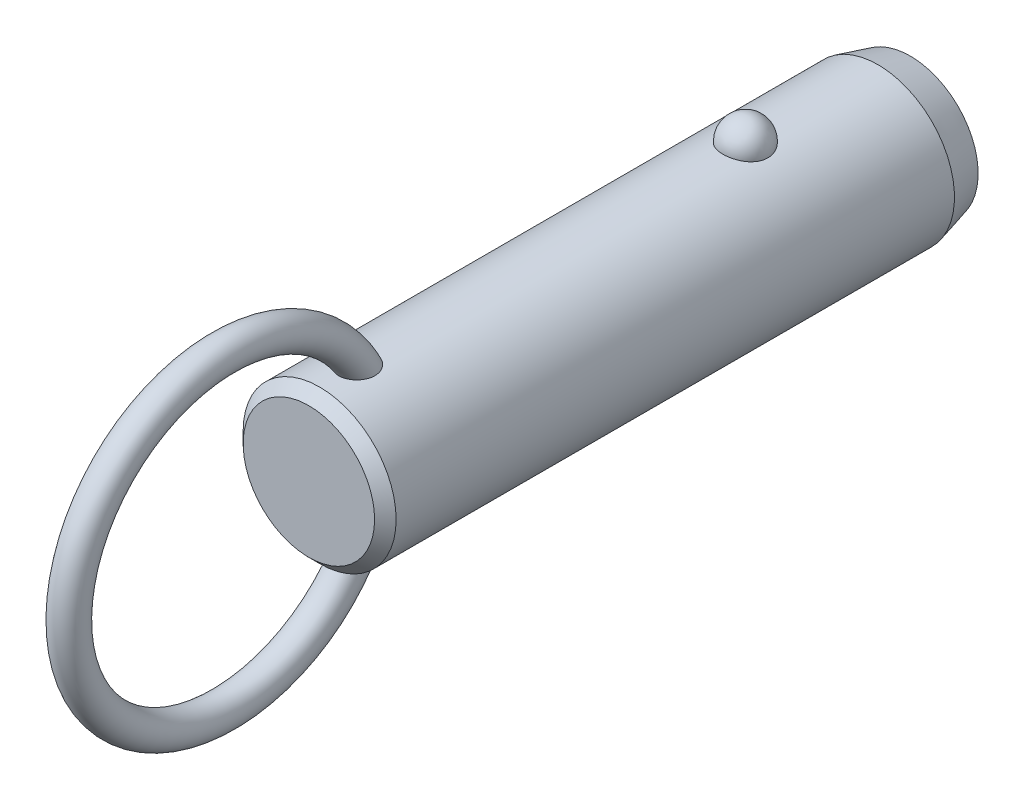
ISO-10303-21;
HEADER;
FILE_DESCRIPTION(('STEP AP214'),'2;1');
FILE_NAME('part.step','',(''),(''),'','','');
FILE_SCHEMA(('AUTOMOTIVE_DESIGN { 1 0 10303 214 1 1 1 1 }'));
ENDSEC;
DATA;
#1=APPLICATION_CONTEXT('core data for automotive mechanical design processes');
#2=APPLICATION_PROTOCOL_DEFINITION('international standard','automotive_design',2000,#1);
#3=PRODUCT_CONTEXT('',#1,'mechanical');
#4=PRODUCT('Part','Part','',(#3));
#5=PRODUCT_RELATED_PRODUCT_CATEGORY('part','',(#4));
#6=PRODUCT_DEFINITION_FORMATION('','',#4);
#7=PRODUCT_DEFINITION_CONTEXT('part definition',#1,'design');
#8=PRODUCT_DEFINITION('design','',#6,#7);
#9=PRODUCT_DEFINITION_SHAPE('','',#8);
#10=(LENGTH_UNIT() NAMED_UNIT(*) SI_UNIT(.MILLI.,.METRE.));
#11=(NAMED_UNIT(*) PLANE_ANGLE_UNIT() SI_UNIT($,.RADIAN.));
#12=(NAMED_UNIT(*) SI_UNIT($,.STERADIAN.) SOLID_ANGLE_UNIT());
#13=UNCERTAINTY_MEASURE_WITH_UNIT(LENGTH_MEASURE(1.E-05),#10,'distance_accuracy_value','');
#14=(GEOMETRIC_REPRESENTATION_CONTEXT(3) GLOBAL_UNCERTAINTY_ASSIGNED_CONTEXT((#13)) GLOBAL_UNIT_ASSIGNED_CONTEXT((#10,
#11,#12)) REPRESENTATION_CONTEXT('',''));
#15=CARTESIAN_POINT('',(0.,0.,0.));
#16=DIRECTION('',(0.,0.,1.));
#17=DIRECTION('',(1.,0.,0.));
#18=AXIS2_PLACEMENT_3D('',#15,#16,#17);
#19=CARTESIAN_POINT('',(0.,0.,30.5));
#20=DIRECTION('',(0.,0.,-1.));
#21=DIRECTION('',(-1.,0.,0.));
#22=AXIS2_PLACEMENT_3D('',#19,#20,#21);
#23=CYLINDRICAL_SURFACE('',#22,7.1);
#24=CARTESIAN_POINT('',(2.0769088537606,6.78943661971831,-2.1));
#25=CARTESIAN_POINT('',(2.07690739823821,6.78943796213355,-1.98268154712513));
#26=CARTESIAN_POINT('',(2.06738130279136,6.79237331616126,-1.86534506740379));
#27=CARTESIAN_POINT('',(2.0295040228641,6.8037853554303,-1.63400788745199));
#28=CARTESIAN_POINT('',(2.00114757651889,6.81226358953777,-1.52000812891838));
#29=CARTESIAN_POINT('',(1.92632025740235,6.83379798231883,-1.29863433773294));
#30=CARTESIAN_POINT('',(1.87985726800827,6.84685214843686,-1.19125744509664));
#31=CARTESIAN_POINT('',(1.76995205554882,6.87608091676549,-0.986046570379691));
#32=CARTESIAN_POINT('',(1.70650980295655,6.8922555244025,-0.888212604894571));
#33=CARTESIAN_POINT('',(1.56381192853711,6.92602930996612,-0.704242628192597));
#34=CARTESIAN_POINT('',(1.4844714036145,6.94363582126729,-0.618173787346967));
#35=CARTESIAN_POINT('',(1.31221746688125,6.97823658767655,-0.460740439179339));
#36=CARTESIAN_POINT('',(1.21930409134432,6.99523084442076,-0.389375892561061));
#37=CARTESIAN_POINT('',(1.02268781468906,7.02666176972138,-0.263547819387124));
#38=CARTESIAN_POINT('',(0.919020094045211,7.04110638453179,-0.209031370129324));
#39=CARTESIAN_POINT('',(0.703548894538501,7.06588726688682,-0.118163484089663));
#40=CARTESIAN_POINT('',(0.591746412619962,7.07622403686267,-0.081809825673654));
#41=CARTESIAN_POINT('',(0.365557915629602,7.09147068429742,-0.0288711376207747));
#42=CARTESIAN_POINT('',(0.251267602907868,7.09648447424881,-0.0119070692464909));
#43=CARTESIAN_POINT('',(0.0213499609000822,7.10089837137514,0.00304925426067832));
#44=CARTESIAN_POINT('',(-0.094277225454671,7.10029907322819,0.00104351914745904));
#45=CARTESIAN_POINT('',(-0.321651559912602,7.09360829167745,-0.021693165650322));
#46=CARTESIAN_POINT('',(-0.433431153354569,7.08760388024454,-0.0421272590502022));
#47=CARTESIAN_POINT('',(-0.651862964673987,7.07086131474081,-0.100729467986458));
#48=CARTESIAN_POINT('',(-0.758515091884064,7.06012307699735,-0.138897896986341));
#49=CARTESIAN_POINT('',(-0.964449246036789,7.03496097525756,-0.232213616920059));
#50=CARTESIAN_POINT('',(-1.06368095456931,7.02051445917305,-0.287465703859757));
#51=CARTESIAN_POINT('',(-1.25145353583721,6.98948740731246,-0.413383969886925));
#52=CARTESIAN_POINT('',(-1.33999321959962,6.97290663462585,-0.48405186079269));
#53=CARTESIAN_POINT('',(-1.50591604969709,6.93898770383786,-0.640594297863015));
#54=CARTESIAN_POINT('',(-1.58302488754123,6.92164094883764,-0.72675782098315));
#55=CARTESIAN_POINT('',(-1.72189320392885,6.8884103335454,-0.910927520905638));
#56=CARTESIAN_POINT('',(-1.78365144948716,6.87252659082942,-1.008934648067));
#57=CARTESIAN_POINT('',(-1.89101272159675,6.84377189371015,-1.21549497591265));
#58=CARTESIAN_POINT('',(-1.93639553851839,6.83094274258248,-1.32416860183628));
#59=CARTESIAN_POINT('',(-2.00874275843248,6.81002070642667,-1.54791500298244));
#60=CARTESIAN_POINT('',(-2.03570774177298,6.80192767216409,-1.66298757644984));
#61=CARTESIAN_POINT('',(-2.07047276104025,6.7914266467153,-1.89571453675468));
#62=CARTESIAN_POINT('',(-2.07835878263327,6.78899315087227,-2.01335491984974));
#63=CARTESIAN_POINT('',(-2.07502083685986,6.79001409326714,-2.24833570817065));
#64=CARTESIAN_POINT('',(-2.06379746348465,6.7934683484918,-2.36567612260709));
#65=CARTESIAN_POINT('',(-2.02263913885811,6.80583442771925,-2.59603194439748));
#66=CARTESIAN_POINT('',(-1.99281127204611,6.81471501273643,-2.70906820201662));
#67=CARTESIAN_POINT('',(-1.91526639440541,6.83691232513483,-2.92836575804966));
#68=CARTESIAN_POINT('',(-1.8675486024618,6.85022924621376,-3.03462676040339));
#69=CARTESIAN_POINT('',(-1.75504492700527,6.87991336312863,-3.23806487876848));
#70=CARTESIAN_POINT('',(-1.69015924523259,6.89629822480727,-3.33518422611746));
#71=CARTESIAN_POINT('',(-1.54505404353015,6.93024852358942,-3.51697105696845));
#72=CARTESIAN_POINT('',(-1.46483385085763,6.94781401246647,-3.60163799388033));
#73=CARTESIAN_POINT('',(-1.29071406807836,6.98225977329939,-3.75654119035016));
#74=CARTESIAN_POINT('',(-1.19675650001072,6.99913673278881,-3.82671308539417));
#75=CARTESIAN_POINT('',(-0.997940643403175,7.03023618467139,-3.9501837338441));
#76=CARTESIAN_POINT('',(-0.893083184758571,7.04445887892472,-4.00348377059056));
#77=CARTESIAN_POINT('',(-0.676902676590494,7.06848365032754,-4.09107242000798));
#78=CARTESIAN_POINT('',(-0.565686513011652,7.0783430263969,-4.12560889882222));
#79=CARTESIAN_POINT('',(-0.338739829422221,7.09282534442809,-4.17575450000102));
#80=CARTESIAN_POINT('',(-0.223009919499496,7.09744899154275,-4.19136617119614));
#81=CARTESIAN_POINT('',(0.00707628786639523,7.10090930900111,-4.20307965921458));
#82=CARTESIAN_POINT('',(0.121410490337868,7.09986531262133,-4.19958377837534));
#83=CARTESIAN_POINT('',(0.347815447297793,7.09238000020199,-4.17411564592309));
#84=CARTESIAN_POINT('',(0.459886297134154,7.08593891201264,-4.15214417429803));
#85=CARTESIAN_POINT('',(0.678084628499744,7.06838983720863,-4.09049562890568));
#86=CARTESIAN_POINT('',(0.784237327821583,7.05730369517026,-4.05090137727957));
#87=CARTESIAN_POINT('',(0.988305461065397,7.03163139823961,-3.95511447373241));
#88=CARTESIAN_POINT('',(1.08622031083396,7.01704499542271,-3.89892064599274));
#89=CARTESIAN_POINT('',(1.27284490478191,6.98562668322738,-3.77035541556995));
#90=CARTESIAN_POINT('',(1.36137372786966,6.96876135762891,-3.69772964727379));
#91=CARTESIAN_POINT('',(1.52509486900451,6.93477412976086,-3.53878279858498));
#92=CARTESIAN_POINT('',(1.60028496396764,6.91765218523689,-3.45245943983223));
#93=CARTESIAN_POINT('',(1.73681688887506,6.88465753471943,-3.26658774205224));
#94=CARTESIAN_POINT('',(1.79785966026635,6.86881574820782,-3.16681408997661));
#95=CARTESIAN_POINT('',(1.90265327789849,6.84053157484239,-2.95814408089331));
#96=CARTESIAN_POINT('',(1.94640861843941,6.82808830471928,-2.84925010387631));
#97=CARTESIAN_POINT('',(2.01274378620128,6.80881460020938,-2.63454318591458));
#98=CARTESIAN_POINT('',(2.03676193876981,6.80160856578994,-2.52920574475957));
#99=CARTESIAN_POINT('',(2.06884490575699,6.79191902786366,-2.3159172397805));
#100=CARTESIAN_POINT('',(2.07691019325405,6.78943538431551,-2.20796625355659));
#101=CARTESIAN_POINT('',(2.0769088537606,6.78943661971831,-2.1));
#102=B_SPLINE_CURVE_WITH_KNOTS('',3,(#24,#25,#26,#27,#28,#29,#30,#31,#32,#33,#34,#35,#36,#37,
#38,#39,#40,#41,#42,#43,#44,#45,#46,#47,#48,#49,#50,#51,#52,#53,#54,#55,#56,#57,#58,#59,#60,#61,
#62,#63,#64,#65,#66,#67,#68,#69,#70,#71,#72,#73,#74,#75,#76,#77,#78,#79,#80,#81,#82,#83,#84,#85,
#86,#87,#88,#89,#90,#91,#92,#93,#94,#95,#96,#97,#98,#99,#100,#101),.UNSPECIFIED.,.T.,.F.,(4,2,2,
2,2,2,2,2,2,2,2,2,2,2,2,2,2,2,2,2,2,2,2,2,2,2,2,2,2,2,2,2,2,2,2,2,2,2,4),(0.,0.351568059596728,
0.703234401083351,1.05474780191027,1.40626181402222,1.75970563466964,2.11314851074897,
2.4654696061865,2.81774759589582,3.16301449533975,3.50824481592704,3.84801136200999,
4.18778391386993,4.52968352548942,4.87162112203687,5.22076181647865,5.56993054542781,
5.92363364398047,6.27732559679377,6.62942052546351,6.98150450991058,7.33158042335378,
7.68167162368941,8.03384443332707,8.38603269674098,8.73975272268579,9.09344583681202,
9.44234545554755,9.79119807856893,10.1327344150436,10.4742563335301,10.8141898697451,
11.1541474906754,11.4997793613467,11.8454687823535,12.1979079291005,12.5502553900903,
12.8738073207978,13.1973496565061),.UNSPECIFIED.);
#103=CARTESIAN_POINT('',(2.0769088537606,6.78943661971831,-2.1));
#104=VERTEX_POINT('',#103);
#105=EDGE_CURVE('E41',#104,#104,#102,.T.);
#106=ORIENTED_EDGE('',*,*,#105,.T.);
#107=EDGE_LOOP('',(#106));
#108=FACE_BOUND('',#107,.T.);
#109=CARTESIAN_POINT('',(0.,0.,37.42));
#110=DIRECTION('',(0.,0.,1.));
#111=DIRECTION('',(1.,0.,0.));
#112=AXIS2_PLACEMENT_3D('',#109,#110,#111);
#113=CIRCLE('',#112,7.1);
#114=CARTESIAN_POINT('',(7.1,0.,37.42));
#115=VERTEX_POINT('',#114);
#116=EDGE_CURVE('E10',#115,#115,#113,.F.);
#117=ORIENTED_EDGE('',*,*,#116,.T.);
#118=EDGE_LOOP('',(#117));
#119=FACE_BOUND('',#118,.T.);
#120=CARTESIAN_POINT('',(-0.429539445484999,-7.08699541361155,32.2429212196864));
#121=CARTESIAN_POINT('',(-0.508331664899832,-7.08221999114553,32.2668764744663));
#122=CARTESIAN_POINT('',(-0.58503984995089,-7.07624016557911,32.2974570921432));
#123=CARTESIAN_POINT('',(-0.732082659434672,-7.06254296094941,32.3710242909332));
#124=CARTESIAN_POINT('',(-0.802417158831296,-7.05482554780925,32.4140111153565));
#125=CARTESIAN_POINT('',(-0.934722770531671,-7.03851844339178,32.5111135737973));
#126=CARTESIAN_POINT('',(-0.996700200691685,-7.02992941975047,32.5652207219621));
#127=CARTESIAN_POINT('',(-1.11079942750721,-7.01280697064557,32.6829676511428));
#128=CARTESIAN_POINT('',(-1.16292136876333,-7.00427354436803,32.7466072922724));
#129=CARTESIAN_POINT('',(-1.25705660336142,-6.98799959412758,32.8826870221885));
#130=CARTESIAN_POINT('',(-1.29888032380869,-6.98027525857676,32.9552598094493));
#131=CARTESIAN_POINT('',(-1.37069920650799,-6.96652886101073,33.1061686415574));
#132=CARTESIAN_POINT('',(-1.40069157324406,-6.96050720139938,33.1845060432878));
#133=CARTESIAN_POINT('',(-1.45043507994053,-6.95031881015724,33.3501903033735));
#134=CARTESIAN_POINT('',(-1.46937115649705,-6.94630231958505,33.4377897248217));
#135=CARTESIAN_POINT('',(-1.49424917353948,-6.94099239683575,33.6148714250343));
#136=CARTESIAN_POINT('',(-1.50018601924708,-6.93970003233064,33.7043544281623));
#137=CARTESIAN_POINT('',(-1.49978214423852,-6.93978815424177,33.8940607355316));
#138=CARTESIAN_POINT('',(-1.49187639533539,-6.94150934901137,33.994279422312));
#139=CARTESIAN_POINT('',(-1.46177925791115,-6.94790814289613,34.1924798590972));
#140=CARTESIAN_POINT('',(-1.43957541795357,-6.95258831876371,34.290459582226));
#141=CARTESIAN_POINT('',(-1.37783293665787,-6.96510647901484,34.4953629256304));
#142=CARTESIAN_POINT('',(-1.33634073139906,-6.97328848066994,34.6016801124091));
#143=CARTESIAN_POINT('',(-1.23686994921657,-6.99161706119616,34.8061777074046));
#144=CARTESIAN_POINT('',(-1.17889192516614,-7.00176357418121,34.9043583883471));
#145=CARTESIAN_POINT('',(-1.0587512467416,-7.02082898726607,35.0723743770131));
#146=CARTESIAN_POINT('',(-0.999247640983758,-7.02963746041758,35.1441230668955));
#147=CARTESIAN_POINT('',(-0.869494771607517,-7.04686074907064,35.2771959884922));
#148=CARTESIAN_POINT('',(-0.799263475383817,-7.05527619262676,35.3385372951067));
#149=CARTESIAN_POINT('',(-0.665408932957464,-7.06899457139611,35.4351316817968));
#150=CARTESIAN_POINT('',(-0.603817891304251,-7.07457275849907,35.4731512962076));
#151=CARTESIAN_POINT('',(-0.475172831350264,-7.08437420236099,35.5387581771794));
#152=CARTESIAN_POINT('',(-0.408123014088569,-7.08859848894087,35.5663533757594));
#153=CARTESIAN_POINT('',(-0.269431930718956,-7.09522749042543,35.6092569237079));
#154=CARTESIAN_POINT('',(-0.197757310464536,-7.09761688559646,35.6244618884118));
#155=CARTESIAN_POINT('',(-0.0527849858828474,-7.10017268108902,35.6407168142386));
#156=CARTESIAN_POINT('',(0.0205115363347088,-7.10034065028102,35.6417767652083));
#157=CARTESIAN_POINT('',(0.156426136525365,-7.09855986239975,35.6304619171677));
#158=CARTESIAN_POINT('',(0.219199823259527,-7.09688191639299,35.6198060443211));
#159=CARTESIAN_POINT('',(0.342134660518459,-7.09201880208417,35.5885379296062));
#160=CARTESIAN_POINT('',(0.402295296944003,-7.08883333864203,35.5679237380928));
#161=CARTESIAN_POINT('',(0.520687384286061,-7.08113868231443,35.5172125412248));
#162=CARTESIAN_POINT('',(0.578791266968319,-7.07658958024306,35.4868272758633));
#163=CARTESIAN_POINT('',(0.690173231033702,-7.06659708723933,35.4183678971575));
#164=CARTESIAN_POINT('',(0.743447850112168,-7.061153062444,35.3802883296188));
#165=CARTESIAN_POINT('',(0.870947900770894,-7.04680292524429,35.2765929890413));
#166=CARTESIAN_POINT('',(0.94182890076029,-7.0375580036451,35.2068972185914));
#167=CARTESIAN_POINT('',(1.07136606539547,-7.01900793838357,35.0569450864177));
#168=CARTESIAN_POINT('',(1.13000013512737,-7.00970271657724,34.9766700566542));
#169=CARTESIAN_POINT('',(1.23579584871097,-6.99183327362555,34.8068997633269));
#170=CARTESIAN_POINT('',(1.2827427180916,-6.98328455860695,34.7172696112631));
#171=CARTESIAN_POINT('',(1.36351442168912,-6.96796352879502,34.5321763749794));
#172=CARTESIAN_POINT('',(1.39733971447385,-6.96119115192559,34.4367134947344));
#173=CARTESIAN_POINT('',(1.45579181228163,-6.94922464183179,34.2253092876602));
#174=CARTESIAN_POINT('',(1.47790145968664,-6.94449000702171,34.108631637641));
#175=CARTESIAN_POINT('',(1.50168752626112,-6.93938731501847,33.8730153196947));
#176=CARTESIAN_POINT('',(1.50336085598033,-6.93901991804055,33.7540763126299));
#177=CARTESIAN_POINT('',(1.48486516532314,-6.9430010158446,33.5236079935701));
#178=CARTESIAN_POINT('',(1.46573441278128,-6.9471253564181,33.4119958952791));
#179=CARTESIAN_POINT('',(1.40606892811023,-6.95944667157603,33.1948868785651));
#180=CARTESIAN_POINT('',(1.3655644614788,-6.96763788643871,33.0893815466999));
#181=CARTESIAN_POINT('',(1.27082700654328,-6.98548038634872,32.9042879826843));
#182=CARTESIAN_POINT('',(1.21949810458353,-6.99473841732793,32.8231719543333));
#183=CARTESIAN_POINT('',(1.10242050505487,-7.01414069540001,32.6722278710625));
#184=CARTESIAN_POINT('',(1.03668119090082,-7.02428436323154,32.6023925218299));
#185=CARTESIAN_POINT('',(0.900559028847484,-7.04295285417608,32.4835735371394));
#186=CARTESIAN_POINT('',(0.831428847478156,-7.05153466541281,32.4331573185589));
#187=CARTESIAN_POINT('',(0.685291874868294,-7.06723150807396,32.3451429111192));
#188=CARTESIAN_POINT('',(0.608287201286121,-7.0743469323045,32.3075412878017));
#189=CARTESIAN_POINT('',(0.451878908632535,-7.08602232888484,32.2474915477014));
#190=CARTESIAN_POINT('',(0.372686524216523,-7.09067127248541,32.2245088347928));
#191=CARTESIAN_POINT('',(0.211477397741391,-7.09730788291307,32.1920357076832));
#192=CARTESIAN_POINT('',(0.129460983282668,-7.09929585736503,32.1825437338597));
#193=CARTESIAN_POINT('',(-0.0332905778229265,-7.10037858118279,32.1773517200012));
#194=CARTESIAN_POINT('',(-0.114016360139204,-7.09953334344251,32.1813656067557));
#195=CARTESIAN_POINT('',(-0.273670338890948,-7.09517338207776,32.2024540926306));
#196=CARTESIAN_POINT('',(-0.352598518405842,-7.09165863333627,32.2195288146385));
#197=CARTESIAN_POINT('',(-0.429539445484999,-7.08699541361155,32.2429212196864));
#198=B_SPLINE_CURVE_WITH_KNOTS('',3,(#120,#121,#122,#123,#124,#125,#126,#127,#128,#129,#130,
#131,#132,#133,#134,#135,#136,#137,#138,#139,#140,#141,#142,#143,#144,#145,#146,#147,#148,#149,
#150,#151,#152,#153,#154,#155,#156,#157,#158,#159,#160,#161,#162,#163,#164,#165,#166,#167,#168,
#169,#170,#171,#172,#173,#174,#175,#176,#177,#178,#179,#180,#181,#182,#183,#184,#185,#186,#187,
#188,#189,#190,#191,#192,#193,#194,#195,#196,#197),.UNSPECIFIED.,.T.,.F.,(4,2,2,2,2,2,2,2,2,2,2,
2,2,2,2,2,2,2,2,2,2,2,2,2,2,2,2,2,2,2,2,2,2,2,2,2,2,2,4),(0.,0.247183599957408,
0.494372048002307,0.741372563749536,0.988369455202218,1.23962059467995,1.49093106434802,
1.75897818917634,2.02713035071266,2.32758265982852,2.62829697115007,2.97008736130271,
3.31186629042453,3.5917531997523,3.87117637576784,4.08813841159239,4.30493502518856,
4.52352259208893,4.7419557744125,4.93215328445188,5.12238804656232,5.31884850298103,
5.51544871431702,5.81332317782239,6.11173048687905,6.41527266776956,6.71880423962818,
7.07358156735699,7.42841252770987,7.76631485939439,8.10373999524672,8.39142246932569,
8.67891817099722,8.93560332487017,9.19221962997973,9.43881106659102,9.68537399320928,
9.92674752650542,10.1681233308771),.UNSPECIFIED.);
#199=CARTESIAN_POINT('',(-0.429539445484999,-7.08699541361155,32.2429212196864));
#200=VERTEX_POINT('',#199);
#201=EDGE_CURVE('E60',#200,#200,#198,.T.);
#202=ORIENTED_EDGE('',*,*,#201,.T.);
#203=EDGE_LOOP('',(#202));
#204=FACE_BOUND('',#203,.T.);
#205=CARTESIAN_POINT('',(-0.429539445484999,7.08699541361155,32.2429212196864));
#206=CARTESIAN_POINT('',(-0.351665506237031,7.09171429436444,32.2192469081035));
#207=CARTESIAN_POINT('',(-0.271733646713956,7.09525896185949,32.2020369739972));
#208=CARTESIAN_POINT('',(-0.110026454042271,7.09960839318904,32.1810059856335));
#209=CARTESIAN_POINT('',(-0.0282502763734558,7.10041187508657,32.177191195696));
#210=CARTESIAN_POINT('',(0.134782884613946,7.09918849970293,32.183059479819));
#211=CARTESIAN_POINT('',(0.216039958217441,7.09716214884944,32.1927401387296));
#212=CARTESIAN_POINT('',(0.375730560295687,7.09050177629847,32.2253471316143));
#213=CARTESIAN_POINT('',(0.454164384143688,7.08586802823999,32.2482720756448));
#214=CARTESIAN_POINT('',(0.606025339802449,7.07449911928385,32.306771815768));
#215=CARTESIAN_POINT('',(0.679451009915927,7.06776334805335,32.3423502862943));
#216=CARTESIAN_POINT('',(0.819234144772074,7.05292866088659,32.4251753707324));
#217=CARTESIAN_POINT('',(0.885591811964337,7.04482978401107,32.4724216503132));
#218=CARTESIAN_POINT('',(1.00993211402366,7.02808709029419,32.5775902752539));
#219=CARTESIAN_POINT('',(1.06785399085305,7.01943990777,32.635583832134));
#220=CARTESIAN_POINT('',(1.17342527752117,7.00256662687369,32.7603013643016));
#221=CARTESIAN_POINT('',(1.22107408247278,6.99434055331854,32.8270258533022));
#222=CARTESIAN_POINT('',(1.30652927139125,6.97889183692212,32.9693622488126));
#223=CARTESIAN_POINT('',(1.34399711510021,6.97170674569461,33.0451808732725));
#224=CARTESIAN_POINT('',(1.40682616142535,6.95930080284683,33.2018100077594));
#225=CARTESIAN_POINT('',(1.43218374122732,6.95408053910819,33.2826220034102));
#226=CARTESIAN_POINT('',(1.47246409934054,6.94566853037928,33.4535314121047));
#227=CARTESIAN_POINT('',(1.48642590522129,6.9426653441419,33.5438630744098));
#228=CARTESIAN_POINT('',(1.5011410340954,6.93949744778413,33.725619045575));
#229=CARTESIAN_POINT('',(1.50188917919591,6.93933385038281,33.8170437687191));
#230=CARTESIAN_POINT('',(1.49030464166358,6.94183245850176,34.0108438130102));
#231=CARTESIAN_POINT('',(1.47627413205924,6.94486147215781,34.113112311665));
#232=CARTESIAN_POINT('',(1.43356351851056,6.95380194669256,34.3144719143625));
#233=CARTESIAN_POINT('',(1.4048676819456,6.95971650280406,34.4135594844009));
#234=CARTESIAN_POINT('',(1.32908750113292,6.97461208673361,34.6189087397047));
#235=CARTESIAN_POINT('',(1.28011435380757,6.98388945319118,34.7244566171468));
#236=CARTESIAN_POINT('',(1.16520357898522,7.00397743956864,34.9257604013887));
#237=CARTESIAN_POINT('',(1.09927694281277,7.01478706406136,35.0215225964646));
#238=CARTESIAN_POINT('',(0.969361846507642,7.03373936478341,35.1767565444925));
#239=CARTESIAN_POINT('',(0.909042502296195,7.04187023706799,35.2393032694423));
#240=CARTESIAN_POINT('',(0.779178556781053,7.05741732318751,35.3540535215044));
#241=CARTESIAN_POINT('',(0.709649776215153,7.06483472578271,35.4062744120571));
#242=CARTESIAN_POINT('',(0.576854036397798,7.0767751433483,35.4881138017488));
#243=CARTESIAN_POINT('',(0.515118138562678,7.08158033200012,35.5201641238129));
#244=CARTESIAN_POINT('',(0.38712798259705,7.08972701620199,35.5737656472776));
#245=CARTESIAN_POINT('',(0.320877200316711,7.09306962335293,35.5953248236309));
#246=CARTESIAN_POINT('',(0.185041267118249,7.09791507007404,35.6264005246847));
#247=CARTESIAN_POINT('',(0.115437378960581,7.09940591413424,35.6358385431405));
#248=CARTESIAN_POINT('',(-0.0243157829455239,7.10030171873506,35.6415226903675));
#249=CARTESIAN_POINT('',(-0.0944648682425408,7.0997073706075,35.6377731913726));
#250=CARTESIAN_POINT('',(-0.225713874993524,7.09668414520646,35.6185081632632));
#251=CARTESIAN_POINT('',(-0.287006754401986,7.09444865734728,35.6042323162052));
#252=CARTESIAN_POINT('',(-0.406555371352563,7.08860360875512,35.5663685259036));
#253=CARTESIAN_POINT('',(-0.46480981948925,7.08499346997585,35.5427766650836));
#254=CARTESIAN_POINT('',(-0.594955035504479,7.07541654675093,35.4789232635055));
#255=CARTESIAN_POINT('',(-0.66538935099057,7.06906574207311,35.435753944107));
#256=CARTESIAN_POINT('',(-0.798242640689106,7.05530261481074,35.338587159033));
#257=CARTESIAN_POINT('',(-0.860645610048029,7.0478882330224,35.2845686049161));
#258=CARTESIAN_POINT('',(-0.994249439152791,7.03045217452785,35.1509965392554));
#259=CARTESIAN_POINT('',(-1.06260129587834,7.02030745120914,35.0686143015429));
#260=CARTESIAN_POINT('',(-1.18502045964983,7.00068382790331,34.893843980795));
#261=CARTESIAN_POINT('',(-1.23907684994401,6.99120544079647,34.801448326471));
#262=CARTESIAN_POINT('',(-1.33335589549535,6.97384343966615,34.6080085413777));
#263=CARTESIAN_POINT('',(-1.3733613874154,6.96598557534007,34.5068564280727));
#264=CARTESIAN_POINT('',(-1.43770677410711,6.9529905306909,34.2995046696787));
#265=CARTESIAN_POINT('',(-1.46204473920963,6.94785368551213,34.19330440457));
#266=CARTESIAN_POINT('',(-1.49537533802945,6.94076296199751,33.9682317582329));
#267=CARTESIAN_POINT('',(-1.50273564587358,6.93914842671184,33.8490975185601));
#268=CARTESIAN_POINT('',(-1.4954555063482,6.94072368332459,33.6114703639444));
#269=CARTESIAN_POINT('',(-1.48082914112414,6.94391040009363,33.4929770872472));
#270=CARTESIAN_POINT('',(-1.43076401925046,6.95438579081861,33.2734325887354));
#271=CARTESIAN_POINT('',(-1.39762227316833,6.96121852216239,33.1718413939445));
#272=CARTESIAN_POINT('',(-1.31211274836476,6.97783941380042,32.9773513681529));
#273=CARTESIAN_POINT('',(-1.2597660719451,6.98762432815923,32.8844431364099));
#274=CARTESIAN_POINT('',(-1.14583073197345,7.00713153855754,32.7241601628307));
#275=CARTESIAN_POINT('',(-1.0866594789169,7.01665982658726,32.6550351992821));
#276=CARTESIAN_POINT('',(-0.956606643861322,7.03556646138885,32.5288786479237));
#277=CARTESIAN_POINT('',(-0.885737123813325,7.04494495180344,32.4718347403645));
#278=CARTESIAN_POINT('',(-0.751558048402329,7.06035735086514,32.3831004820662));
#279=CARTESIAN_POINT('',(-0.690120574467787,7.0666695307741,32.3485932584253));
#280=CARTESIAN_POINT('',(-0.562815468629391,7.07794609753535,32.2887507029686));
#281=CARTESIAN_POINT('',(-0.496948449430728,7.08291067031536,32.2634141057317));
#282=CARTESIAN_POINT('',(-0.429539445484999,7.08699541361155,32.2429212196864));
#283=B_SPLINE_CURVE_WITH_KNOTS('',3,(#205,#206,#207,#208,#209,#210,#211,#212,#213,#214,#215,
#216,#217,#218,#219,#220,#221,#222,#223,#224,#225,#226,#227,#228,#229,#230,#231,#232,#233,#234,
#235,#236,#237,#238,#239,#240,#241,#242,#243,#244,#245,#246,#247,#248,#249,#250,#251,#252,#253,
#254,#255,#256,#257,#258,#259,#260,#261,#262,#263,#264,#265,#266,#267,#268,#269,#270,#271,#272,
#273,#274,#275,#276,#277,#278,#279,#280,#281,#282),.UNSPECIFIED.,.T.,.F.,(4,2,2,2,2,2,2,2,2,2,2,
2,2,2,2,2,2,2,2,2,2,2,2,2,2,2,2,2,2,2,2,2,2,2,2,2,2,2,4),(0.,0.244335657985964,0.48878556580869,
0.733191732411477,0.977572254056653,1.22202379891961,1.46646834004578,1.71259457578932,
1.9587352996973,2.21226768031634,2.46587585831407,2.7391381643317,3.01250754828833,
3.32109936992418,3.63002293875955,3.97863512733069,4.32702187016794,4.58793945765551,
4.84841449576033,5.05676704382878,5.26496096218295,5.47449661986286,5.68396281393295,
5.87205447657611,6.06022532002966,6.30743751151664,6.55513496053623,6.87602468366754,
7.19715875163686,7.52305774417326,7.84899686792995,8.20516155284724,8.56109821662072,
8.8804008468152,9.19935367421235,9.47236282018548,9.74509220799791,9.95662250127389,
10.1681235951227),.UNSPECIFIED.);
#284=CARTESIAN_POINT('',(-0.429539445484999,7.08699541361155,32.2429212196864));
#285=VERTEX_POINT('',#284);
#286=EDGE_CURVE('E68',#285,#285,#283,.T.);
#287=ORIENTED_EDGE('',*,*,#286,.T.);
#288=EDGE_LOOP('',(#287));
#289=FACE_BOUND('',#288,.T.);
#290=CARTESIAN_POINT('',(0.,0.,-14.4000000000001));
#291=DIRECTION('',(0.,0.,-1.));
#292=DIRECTION('',(-1.,0.,0.));
#293=AXIS2_PLACEMENT_3D('',#290,#291,#292);
#294=CIRCLE('',#293,7.1);
#295=CARTESIAN_POINT('',(-7.1,0.,-14.4000000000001));
#296=VERTEX_POINT('',#295);
#297=EDGE_CURVE('E57',#296,#296,#294,.F.);
#298=ORIENTED_EDGE('',*,*,#297,.T.);
#299=EDGE_LOOP('',(#298));
#300=FACE_BOUND('',#299,.T.);
#301=ADVANCED_FACE('F37',(#108,#119,#204,#289,#300),#23,.T.);
#302=CARTESIAN_POINT('',(0.,0.,-17.4));
#303=DIRECTION('',(0.,0.,-1.));
#304=DIRECTION('',(-1.,0.,0.));
#305=AXIS2_PLACEMENT_3D('',#302,#303,#304);
#306=PLANE('',#305);
#307=CARTESIAN_POINT('',(0.,0.,-17.4));
#308=DIRECTION('',(0.,0.,-1.));
#309=DIRECTION('',(-1.,0.,0.));
#310=AXIS2_PLACEMENT_3D('',#307,#308,#309);
#311=CIRCLE('',#310,6.29615242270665);
#312=CARTESIAN_POINT('',(-6.29615242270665,0.,-17.4));
#313=VERTEX_POINT('',#312);
#314=EDGE_CURVE('E67',#313,#313,#311,.T.);
#315=ORIENTED_EDGE('',*,*,#314,.T.);
#316=EDGE_LOOP('',(#315));
#317=FACE_BOUND('',#316,.T.);
#318=ADVANCED_FACE('F86',(#317),#306,.T.);
#319=CARTESIAN_POINT('',(0.,0.,-17.4));
#320=DIRECTION('',(0.,0.,1.));
#321=DIRECTION('',(1.,0.,0.));
#322=AXIS2_PLACEMENT_3D('',#319,#320,#321);
#323=CONICAL_SURFACE('',#322,6.29615242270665,0.261799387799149);
#324=ORIENTED_EDGE('',*,*,#297,.F.);
#325=EDGE_LOOP('',(#324));
#326=FACE_BOUND('',#325,.T.);
#327=ORIENTED_EDGE('',*,*,#314,.F.);
#328=EDGE_LOOP('',(#327));
#329=FACE_BOUND('',#328,.T.);
#330=ADVANCED_FACE('F84',(#326,#329),#323,.T.);
#331=CARTESIAN_POINT('',(0.,0.,38.42));
#332=DIRECTION('',(0.,0.,1.));
#333=DIRECTION('',(1.,0.,0.));
#334=AXIS2_PLACEMENT_3D('',#331,#332,#333);
#335=PLANE('',#334);
#336=CARTESIAN_POINT('',(0.,0.,38.42));
#337=DIRECTION('',(0.,0.,1.));
#338=DIRECTION('',(1.,0.,0.));
#339=AXIS2_PLACEMENT_3D('',#336,#337,#338);
#340=CIRCLE('',#339,6.10000000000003);
#341=CARTESIAN_POINT('',(6.10000000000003,0.,38.42));
#342=VERTEX_POINT('',#341);
#343=EDGE_CURVE('E50',#342,#342,#340,.T.);
#344=ORIENTED_EDGE('',*,*,#343,.T.);
#345=EDGE_LOOP('',(#344));
#346=FACE_BOUND('',#345,.T.);
#347=ADVANCED_FACE('F78',(#346),#335,.T.);
#348=CARTESIAN_POINT('',(0.,0.,46.35));
#349=DIRECTION('',(1.,0.,0.));
#350=DIRECTION('',(0.,0.,-1.));
#351=AXIS2_PLACEMENT_3D('',#348,#349,#350);
#352=TOROIDAL_SURFACE('',#351,14.35,1.5);
#353=ORIENTED_EDGE('',*,*,#286,.F.);
#354=EDGE_LOOP('',(#353));
#355=FACE_BOUND('',#354,.T.);
#356=ORIENTED_EDGE('',*,*,#201,.F.);
#357=EDGE_LOOP('',(#356));
#358=FACE_BOUND('',#357,.T.);
#359=ADVANCED_FACE('F74',(#355,#358),#352,.T.);
#360=CARTESIAN_POINT('',(0.,0.,38.42));
#361=DIRECTION('',(0.,0.,-1.));
#362=DIRECTION('',(-1.,0.,0.));
#363=AXIS2_PLACEMENT_3D('',#360,#361,#362);
#364=CONICAL_SURFACE('',#363,6.10000000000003,0.785398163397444);
#365=ORIENTED_EDGE('',*,*,#116,.F.);
#366=EDGE_LOOP('',(#365));
#367=FACE_BOUND('',#366,.T.);
#368=ORIENTED_EDGE('',*,*,#343,.F.);
#369=EDGE_LOOP('',(#368));
#370=FACE_BOUND('',#369,.T.);
#371=ADVANCED_FACE('F39',(#367,#370),#364,.T.);
#372=CARTESIAN_POINT('',(0.,7.1,-2.1));
#373=DIRECTION('',(0.,1.,0.));
#374=DIRECTION('',(0.,0.,1.));
#375=AXIS2_PLACEMENT_3D('',#372,#373,#374);
#376=SPHERICAL_SURFACE('',#375,2.10000000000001);
#377=ORIENTED_EDGE('',*,*,#105,.F.);
#378=EDGE_LOOP('',(#377));
#379=FACE_BOUND('',#378,.T.);
#380=ADVANCED_FACE('F80',(#379),#376,.T.);
#381=CLOSED_SHELL('',(#301,#318,#330,#347,#359,#371,#380));
#382=MANIFOLD_SOLID_BREP('B2',#381);
#383=ADVANCED_BREP_SHAPE_REPRESENTATION('',(#18,#382),#14);
#384=SHAPE_DEFINITION_REPRESENTATION(#9,#383);
ENDSEC;
END-ISO-10303-21;
